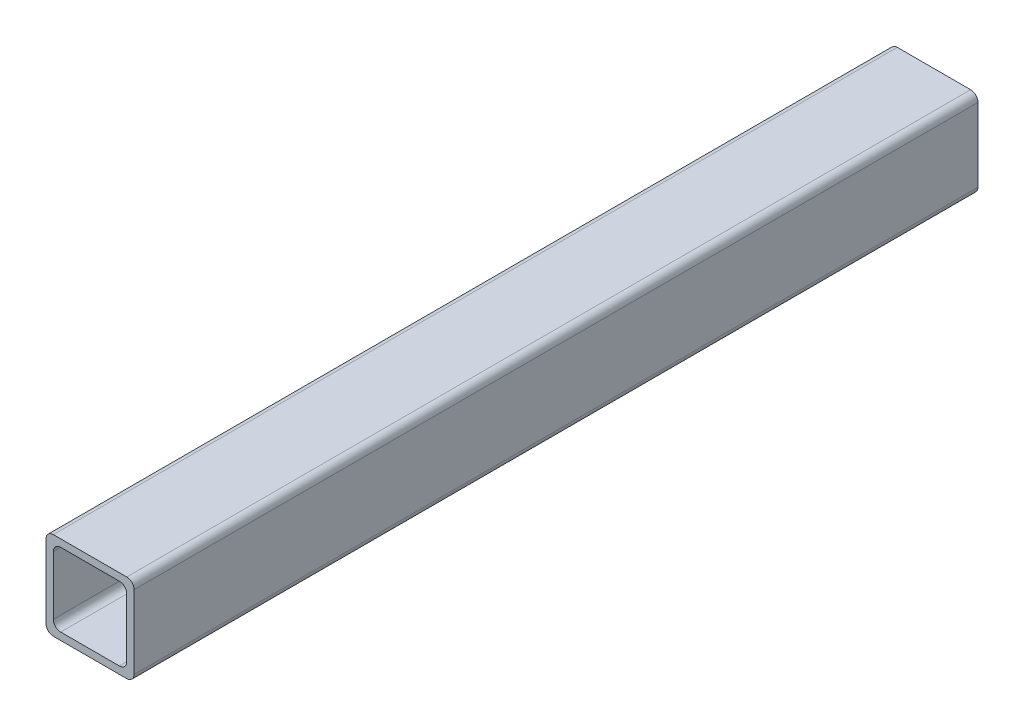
ISO-10303-21;
HEADER;
FILE_DESCRIPTION(('STEP AP214'),'2;1');
FILE_NAME('part.step','',(''),(''),'','','');
FILE_SCHEMA(('AUTOMOTIVE_DESIGN { 1 0 10303 214 1 1 1 1 }'));
ENDSEC;
DATA;
#1=APPLICATION_CONTEXT('core data for automotive mechanical design processes');
#2=APPLICATION_PROTOCOL_DEFINITION('international standard','automotive_design',2000,#1);
#3=PRODUCT_CONTEXT('',#1,'mechanical');
#4=PRODUCT('Part','Part','',(#3));
#5=PRODUCT_RELATED_PRODUCT_CATEGORY('part','',(#4));
#6=PRODUCT_DEFINITION_FORMATION('','',#4);
#7=PRODUCT_DEFINITION_CONTEXT('part definition',#1,'design');
#8=PRODUCT_DEFINITION('design','',#6,#7);
#9=PRODUCT_DEFINITION_SHAPE('','',#8);
#10=(LENGTH_UNIT() NAMED_UNIT(*) SI_UNIT(.MILLI.,.METRE.));
#11=(NAMED_UNIT(*) PLANE_ANGLE_UNIT() SI_UNIT($,.RADIAN.));
#12=(NAMED_UNIT(*) SI_UNIT($,.STERADIAN.) SOLID_ANGLE_UNIT());
#13=UNCERTAINTY_MEASURE_WITH_UNIT(LENGTH_MEASURE(1.E-05),#10,'distance_accuracy_value','');
#14=(GEOMETRIC_REPRESENTATION_CONTEXT(3) GLOBAL_UNCERTAINTY_ASSIGNED_CONTEXT((#13)) GLOBAL_UNIT_ASSIGNED_CONTEXT((#10,
#11,#12)) REPRESENTATION_CONTEXT('',''));
#15=CARTESIAN_POINT('',(0.,0.,0.));
#16=DIRECTION('',(0.,0.,1.));
#17=DIRECTION('',(1.,0.,0.));
#18=AXIS2_PLACEMENT_3D('',#15,#16,#17);
#19=CARTESIAN_POINT('',(50.,-50.,575.));
#20=DIRECTION('',(0.,0.,1.));
#21=DIRECTION('',(1.,0.,0.));
#22=AXIS2_PLACEMENT_3D('',#19,#20,#21);
#23=PLANE('',#22);
#24=CARTESIAN_POINT('',(50.,-50.,575.));
#25=DIRECTION('',(0.,0.,1.));
#26=DIRECTION('',(1.,0.,0.));
#27=AXIS2_PLACEMENT_3D('',#24,#25,#26);
#28=CIRCLE('',#27,10.);
#29=CARTESIAN_POINT('',(49.9999999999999,-60.,575.));
#30=VERTEX_POINT('',#29);
#31=CARTESIAN_POINT('',(60.,-49.9999999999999,575.));
#32=VERTEX_POINT('',#31);
#33=EDGE_CURVE('E250',#30,#32,#28,.T.);
#34=ORIENTED_EDGE('',*,*,#33,.T.);
#35=DIRECTION('',(0.,1.,0.));
#36=VECTOR('',#35,1.);
#37=CARTESIAN_POINT('',(60.,-49.9999999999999,575.));
#38=LINE('',#37,#36);
#39=CARTESIAN_POINT('',(60.,50.,575.));
#40=VERTEX_POINT('',#39);
#41=EDGE_CURVE('E254',#32,#40,#38,.T.);
#42=ORIENTED_EDGE('',*,*,#41,.T.);
#43=CARTESIAN_POINT('',(50.,50.,575.));
#44=DIRECTION('',(0.,0.,1.));
#45=DIRECTION('',(-1.,0.,0.));
#46=AXIS2_PLACEMENT_3D('',#43,#44,#45);
#47=CIRCLE('',#46,10.);
#48=CARTESIAN_POINT('',(49.9999999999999,60.,575.));
#49=VERTEX_POINT('',#48);
#50=EDGE_CURVE('E258',#40,#49,#47,.T.);
#51=ORIENTED_EDGE('',*,*,#50,.T.);
#52=DIRECTION('',(-1.,0.,0.));
#53=VECTOR('',#52,1.);
#54=CARTESIAN_POINT('',(-49.9999999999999,60.,575.));
#55=LINE('',#54,#53);
#56=CARTESIAN_POINT('',(-49.9999999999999,60.,575.));
#57=VERTEX_POINT('',#56);
#58=EDGE_CURVE('E261',#49,#57,#55,.T.);
#59=ORIENTED_EDGE('',*,*,#58,.T.);
#60=CARTESIAN_POINT('',(-50.,50.,575.));
#61=DIRECTION('',(0.,0.,1.));
#62=DIRECTION('',(-1.,0.,0.));
#63=AXIS2_PLACEMENT_3D('',#60,#61,#62);
#64=CIRCLE('',#63,10.);
#65=CARTESIAN_POINT('',(-60.,50.,575.));
#66=VERTEX_POINT('',#65);
#67=EDGE_CURVE('E264',#57,#66,#64,.T.);
#68=ORIENTED_EDGE('',*,*,#67,.T.);
#69=DIRECTION('',(0.,-1.,0.));
#70=VECTOR('',#69,1.);
#71=CARTESIAN_POINT('',(-60.,-49.9999999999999,575.));
#72=LINE('',#71,#70);
#73=CARTESIAN_POINT('',(-60.,-50.,575.));
#74=VERTEX_POINT('',#73);
#75=EDGE_CURVE('E267',#66,#74,#72,.T.);
#76=ORIENTED_EDGE('',*,*,#75,.T.);
#77=CARTESIAN_POINT('',(-50.,-50.,575.));
#78=DIRECTION('',(0.,0.,1.));
#79=DIRECTION('',(-1.,0.,0.));
#80=AXIS2_PLACEMENT_3D('',#77,#78,#79);
#81=CIRCLE('',#80,10.);
#82=CARTESIAN_POINT('',(-49.9999999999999,-60.,575.));
#83=VERTEX_POINT('',#82);
#84=EDGE_CURVE('E270',#74,#83,#81,.T.);
#85=ORIENTED_EDGE('',*,*,#84,.T.);
#86=DIRECTION('',(1.,0.,0.));
#87=VECTOR('',#86,1.);
#88=CARTESIAN_POINT('',(-49.9999999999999,-60.,575.));
#89=LINE('',#88,#87);
#90=EDGE_CURVE('E273',#83,#30,#89,.T.);
#91=ORIENTED_EDGE('',*,*,#90,.T.);
#92=EDGE_LOOP('',(#34,#42,#51,#59,#68,#76,#85,#91));
#93=FACE_BOUND('',#92,.T.);
#94=DIRECTION('',(1.,0.,0.));
#95=VECTOR('',#94,1.);
#96=CARTESIAN_POINT('',(-39.9999999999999,-50.,575.));
#97=LINE('',#96,#95);
#98=CARTESIAN_POINT('',(-39.9999999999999,-50.,575.));
#99=VERTEX_POINT('',#98);
#100=CARTESIAN_POINT('',(39.9999999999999,-50.,575.));
#101=VERTEX_POINT('',#100);
#102=EDGE_CURVE('E168',#99,#101,#97,.T.);
#103=ORIENTED_EDGE('',*,*,#102,.F.);
#104=CARTESIAN_POINT('',(-40.,-40.,575.));
#105=DIRECTION('',(0.,0.,1.));
#106=DIRECTION('',(-1.,0.,0.));
#107=AXIS2_PLACEMENT_3D('',#104,#105,#106);
#108=CIRCLE('',#107,9.99999999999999);
#109=CARTESIAN_POINT('',(-50.,-39.9999999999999,575.));
#110=VERTEX_POINT('',#109);
#111=EDGE_CURVE('E159',#110,#99,#108,.T.);
#112=ORIENTED_EDGE('',*,*,#111,.F.);
#113=DIRECTION('',(0.,-1.,0.));
#114=VECTOR('',#113,1.);
#115=CARTESIAN_POINT('',(-50.,-39.9999999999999,575.));
#116=LINE('',#115,#114);
#117=CARTESIAN_POINT('',(-50.,39.9999999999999,575.));
#118=VERTEX_POINT('',#117);
#119=EDGE_CURVE('E201',#118,#110,#116,.T.);
#120=ORIENTED_EDGE('',*,*,#119,.F.);
#121=CARTESIAN_POINT('',(-40.,40.,575.));
#122=DIRECTION('',(0.,0.,1.));
#123=DIRECTION('',(-1.,0.,0.));
#124=AXIS2_PLACEMENT_3D('',#121,#122,#123);
#125=CIRCLE('',#124,9.99999999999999);
#126=CARTESIAN_POINT('',(-39.9999999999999,50.,575.));
#127=VERTEX_POINT('',#126);
#128=EDGE_CURVE('E198',#127,#118,#125,.T.);
#129=ORIENTED_EDGE('',*,*,#128,.F.);
#130=DIRECTION('',(-1.,0.,0.));
#131=VECTOR('',#130,1.);
#132=CARTESIAN_POINT('',(-39.9999999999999,50.,575.));
#133=LINE('',#132,#131);
#134=CARTESIAN_POINT('',(39.9999999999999,50.,575.));
#135=VERTEX_POINT('',#134);
#136=EDGE_CURVE('E195',#135,#127,#133,.T.);
#137=ORIENTED_EDGE('',*,*,#136,.F.);
#138=CARTESIAN_POINT('',(40.,40.,575.));
#139=DIRECTION('',(0.,0.,1.));
#140=DIRECTION('',(-1.,0.,0.));
#141=AXIS2_PLACEMENT_3D('',#138,#139,#140);
#142=CIRCLE('',#141,9.99999999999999);
#143=CARTESIAN_POINT('',(50.,39.9999999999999,575.));
#144=VERTEX_POINT('',#143);
#145=EDGE_CURVE('E192',#144,#135,#142,.T.);
#146=ORIENTED_EDGE('',*,*,#145,.F.);
#147=DIRECTION('',(0.,1.,0.));
#148=VECTOR('',#147,1.);
#149=CARTESIAN_POINT('',(50.,-39.9999999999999,575.));
#150=LINE('',#149,#148);
#151=CARTESIAN_POINT('',(50.,-40.,575.));
#152=VERTEX_POINT('',#151);
#153=EDGE_CURVE('E186',#152,#144,#150,.T.);
#154=ORIENTED_EDGE('',*,*,#153,.F.);
#155=CARTESIAN_POINT('',(40.,-40.,575.));
#156=DIRECTION('',(0.,0.,1.));
#157=DIRECTION('',(1.,0.,0.));
#158=AXIS2_PLACEMENT_3D('',#155,#156,#157);
#159=CIRCLE('',#158,9.99999999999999);
#160=EDGE_CURVE('E182',#101,#152,#159,.T.);
#161=ORIENTED_EDGE('',*,*,#160,.F.);
#162=EDGE_LOOP('',(#103,#112,#120,#129,#137,#146,#154,#161));
#163=FACE_BOUND('',#162,.T.);
#164=ADVANCED_FACE('F45',(#93,#163),#23,.T.);
#165=CARTESIAN_POINT('',(50.,-50.,-575.));
#166=DIRECTION('',(0.,0.,1.));
#167=DIRECTION('',(1.,0.,0.));
#168=AXIS2_PLACEMENT_3D('',#165,#166,#167);
#169=PLANE('',#168);
#170=CARTESIAN_POINT('',(50.,-50.,-575.));
#171=DIRECTION('',(0.,0.,1.));
#172=DIRECTION('',(1.,0.,0.));
#173=AXIS2_PLACEMENT_3D('',#170,#171,#172);
#174=CIRCLE('',#173,10.);
#175=CARTESIAN_POINT('',(49.9999999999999,-60.,-575.));
#176=VERTEX_POINT('',#175);
#177=CARTESIAN_POINT('',(60.,-49.9999999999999,-575.));
#178=VERTEX_POINT('',#177);
#179=EDGE_CURVE('E177',#176,#178,#174,.T.);
#180=ORIENTED_EDGE('',*,*,#179,.F.);
#181=DIRECTION('',(1.,0.,0.));
#182=VECTOR('',#181,1.);
#183=CARTESIAN_POINT('',(-49.9999999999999,-60.,-575.));
#184=LINE('',#183,#182);
#185=CARTESIAN_POINT('',(-49.9999999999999,-60.,-575.));
#186=VERTEX_POINT('',#185);
#187=EDGE_CURVE('E255',#186,#176,#184,.T.);
#188=ORIENTED_EDGE('',*,*,#187,.F.);
#189=CARTESIAN_POINT('',(-50.,-50.,-575.));
#190=DIRECTION('',(0.,0.,1.));
#191=DIRECTION('',(-1.,0.,0.));
#192=AXIS2_PLACEMENT_3D('',#189,#190,#191);
#193=CIRCLE('',#192,10.);
#194=CARTESIAN_POINT('',(-60.,-50.,-575.));
#195=VERTEX_POINT('',#194);
#196=EDGE_CURVE('E295',#195,#186,#193,.T.);
#197=ORIENTED_EDGE('',*,*,#196,.F.);
#198=DIRECTION('',(0.,-1.,0.));
#199=VECTOR('',#198,1.);
#200=CARTESIAN_POINT('',(-60.,-49.9999999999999,-575.));
#201=LINE('',#200,#199);
#202=CARTESIAN_POINT('',(-60.,50.,-575.));
#203=VERTEX_POINT('',#202);
#204=EDGE_CURVE('E292',#203,#195,#201,.T.);
#205=ORIENTED_EDGE('',*,*,#204,.F.);
#206=CARTESIAN_POINT('',(-50.,50.,-575.));
#207=DIRECTION('',(0.,0.,1.));
#208=DIRECTION('',(-1.,0.,0.));
#209=AXIS2_PLACEMENT_3D('',#206,#207,#208);
#210=CIRCLE('',#209,10.);
#211=CARTESIAN_POINT('',(-49.9999999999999,60.,-575.));
#212=VERTEX_POINT('',#211);
#213=EDGE_CURVE('E289',#212,#203,#210,.T.);
#214=ORIENTED_EDGE('',*,*,#213,.F.);
#215=DIRECTION('',(-1.,0.,0.));
#216=VECTOR('',#215,1.);
#217=CARTESIAN_POINT('',(-49.9999999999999,60.,-575.));
#218=LINE('',#217,#216);
#219=CARTESIAN_POINT('',(49.9999999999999,60.,-575.));
#220=VERTEX_POINT('',#219);
#221=EDGE_CURVE('E286',#220,#212,#218,.T.);
#222=ORIENTED_EDGE('',*,*,#221,.F.);
#223=CARTESIAN_POINT('',(50.,50.,-575.));
#224=DIRECTION('',(0.,0.,1.));
#225=DIRECTION('',(-1.,0.,0.));
#226=AXIS2_PLACEMENT_3D('',#223,#224,#225);
#227=CIRCLE('',#226,10.);
#228=CARTESIAN_POINT('',(60.,50.,-575.));
#229=VERTEX_POINT('',#228);
#230=EDGE_CURVE('E283',#229,#220,#227,.T.);
#231=ORIENTED_EDGE('',*,*,#230,.F.);
#232=DIRECTION('',(0.,1.,0.));
#233=VECTOR('',#232,1.);
#234=CARTESIAN_POINT('',(60.,-49.9999999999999,-575.));
#235=LINE('',#234,#233);
#236=EDGE_CURVE('E280',#178,#229,#235,.T.);
#237=ORIENTED_EDGE('',*,*,#236,.F.);
#238=EDGE_LOOP('',(#180,#188,#197,#205,#214,#222,#231,#237));
#239=FACE_BOUND('',#238,.T.);
#240=CARTESIAN_POINT('',(-40.,-40.,-575.));
#241=DIRECTION('',(0.,0.,1.));
#242=DIRECTION('',(-1.,0.,0.));
#243=AXIS2_PLACEMENT_3D('',#240,#241,#242);
#244=CIRCLE('',#243,9.99999999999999);
#245=CARTESIAN_POINT('',(-50.,-39.9999999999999,-575.));
#246=VERTEX_POINT('',#245);
#247=CARTESIAN_POINT('',(-39.9999999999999,-50.,-575.));
#248=VERTEX_POINT('',#247);
#249=EDGE_CURVE('E69',#246,#248,#244,.T.);
#250=ORIENTED_EDGE('',*,*,#249,.T.);
#251=DIRECTION('',(1.,0.,0.));
#252=VECTOR('',#251,1.);
#253=CARTESIAN_POINT('',(-39.9999999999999,-50.,-575.));
#254=LINE('',#253,#252);
#255=CARTESIAN_POINT('',(39.9999999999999,-50.,-575.));
#256=VERTEX_POINT('',#255);
#257=EDGE_CURVE('E175',#248,#256,#254,.T.);
#258=ORIENTED_EDGE('',*,*,#257,.T.);
#259=CARTESIAN_POINT('',(40.,-40.,-575.));
#260=DIRECTION('',(0.,0.,1.));
#261=DIRECTION('',(1.,0.,0.));
#262=AXIS2_PLACEMENT_3D('',#259,#260,#261);
#263=CIRCLE('',#262,9.99999999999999);
#264=CARTESIAN_POINT('',(50.,-40.,-575.));
#265=VERTEX_POINT('',#264);
#266=EDGE_CURVE('E209',#256,#265,#263,.T.);
#267=ORIENTED_EDGE('',*,*,#266,.T.);
#268=DIRECTION('',(0.,1.,0.));
#269=VECTOR('',#268,1.);
#270=CARTESIAN_POINT('',(50.,-39.9999999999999,-575.));
#271=LINE('',#270,#269);
#272=CARTESIAN_POINT('',(50.,39.9999999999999,-575.));
#273=VERTEX_POINT('',#272);
#274=EDGE_CURVE('E213',#265,#273,#271,.T.);
#275=ORIENTED_EDGE('',*,*,#274,.T.);
#276=CARTESIAN_POINT('',(40.,40.,-575.));
#277=DIRECTION('',(0.,0.,1.));
#278=DIRECTION('',(-1.,0.,0.));
#279=AXIS2_PLACEMENT_3D('',#276,#277,#278);
#280=CIRCLE('',#279,9.99999999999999);
#281=CARTESIAN_POINT('',(39.9999999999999,50.,-575.));
#282=VERTEX_POINT('',#281);
#283=EDGE_CURVE('E217',#273,#282,#280,.T.);
#284=ORIENTED_EDGE('',*,*,#283,.T.);
#285=DIRECTION('',(-1.,0.,0.));
#286=VECTOR('',#285,1.);
#287=CARTESIAN_POINT('',(-39.9999999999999,50.,-575.));
#288=LINE('',#287,#286);
#289=CARTESIAN_POINT('',(-39.9999999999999,50.,-575.));
#290=VERTEX_POINT('',#289);
#291=EDGE_CURVE('E221',#282,#290,#288,.T.);
#292=ORIENTED_EDGE('',*,*,#291,.T.);
#293=CARTESIAN_POINT('',(-40.,40.,-575.));
#294=DIRECTION('',(0.,0.,1.));
#295=DIRECTION('',(-1.,0.,0.));
#296=AXIS2_PLACEMENT_3D('',#293,#294,#295);
#297=CIRCLE('',#296,9.99999999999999);
#298=CARTESIAN_POINT('',(-50.,39.9999999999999,-575.));
#299=VERTEX_POINT('',#298);
#300=EDGE_CURVE('E225',#290,#299,#297,.T.);
#301=ORIENTED_EDGE('',*,*,#300,.T.);
#302=DIRECTION('',(0.,-1.,0.));
#303=VECTOR('',#302,1.);
#304=CARTESIAN_POINT('',(-50.,-39.9999999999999,-575.));
#305=LINE('',#304,#303);
#306=EDGE_CURVE('E169',#299,#246,#305,.T.);
#307=ORIENTED_EDGE('',*,*,#306,.T.);
#308=EDGE_LOOP('',(#250,#258,#267,#275,#284,#292,#301,#307));
#309=FACE_BOUND('',#308,.T.);
#310=ADVANCED_FACE('F334',(#239,#309),#169,.F.);
#311=CARTESIAN_POINT('',(50.,-50.,575.));
#312=DIRECTION('',(0.,0.,-1.));
#313=DIRECTION('',(-1.,0.,0.));
#314=AXIS2_PLACEMENT_3D('',#311,#312,#313);
#315=CYLINDRICAL_SURFACE('',#314,10.);
#316=ORIENTED_EDGE('',*,*,#179,.T.);
#317=DIRECTION('',(0.,0.,-1.));
#318=VECTOR('',#317,1.);
#319=CARTESIAN_POINT('',(60.,-49.9999999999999,575.));
#320=LINE('',#319,#318);
#321=EDGE_CURVE('E11',#32,#178,#320,.T.);
#322=ORIENTED_EDGE('',*,*,#321,.F.);
#323=ORIENTED_EDGE('',*,*,#33,.F.);
#324=DIRECTION('',(0.,0.,-1.));
#325=VECTOR('',#324,1.);
#326=CARTESIAN_POINT('',(49.9999999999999,-60.,575.));
#327=LINE('',#326,#325);
#328=EDGE_CURVE('E276',#30,#176,#327,.T.);
#329=ORIENTED_EDGE('',*,*,#328,.T.);
#330=EDGE_LOOP('',(#316,#322,#323,#329));
#331=FACE_BOUND('',#330,.T.);
#332=ADVANCED_FACE('F47',(#331),#315,.T.);
#333=CARTESIAN_POINT('',(60.,-49.9999999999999,575.));
#334=DIRECTION('',(-1.,0.,0.));
#335=DIRECTION('',(0.,0.,1.));
#336=AXIS2_PLACEMENT_3D('',#333,#334,#335);
#337=PLANE('',#336);
#338=ORIENTED_EDGE('',*,*,#236,.T.);
#339=DIRECTION('',(0.,0.,-1.));
#340=VECTOR('',#339,1.);
#341=CARTESIAN_POINT('',(60.,50.,575.));
#342=LINE('',#341,#340);
#343=EDGE_CURVE('E54',#40,#229,#342,.T.);
#344=ORIENTED_EDGE('',*,*,#343,.F.);
#345=ORIENTED_EDGE('',*,*,#41,.F.);
#346=ORIENTED_EDGE('',*,*,#321,.T.);
#347=EDGE_LOOP('',(#338,#344,#345,#346));
#348=FACE_BOUND('',#347,.T.);
#349=ADVANCED_FACE('F351',(#348),#337,.F.);
#350=CARTESIAN_POINT('',(50.,50.,575.));
#351=DIRECTION('',(0.,0.,-1.));
#352=DIRECTION('',(-1.,0.,0.));
#353=AXIS2_PLACEMENT_3D('',#350,#351,#352);
#354=CYLINDRICAL_SURFACE('',#353,10.);
#355=ORIENTED_EDGE('',*,*,#230,.T.);
#356=DIRECTION('',(0.,0.,-1.));
#357=VECTOR('',#356,1.);
#358=CARTESIAN_POINT('',(49.9999999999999,60.,575.));
#359=LINE('',#358,#357);
#360=EDGE_CURVE('E319',#49,#220,#359,.T.);
#361=ORIENTED_EDGE('',*,*,#360,.F.);
#362=ORIENTED_EDGE('',*,*,#50,.F.);
#363=ORIENTED_EDGE('',*,*,#343,.T.);
#364=EDGE_LOOP('',(#355,#361,#362,#363));
#365=FACE_BOUND('',#364,.T.);
#366=ADVANCED_FACE('F328',(#365),#354,.T.);
#367=CARTESIAN_POINT('',(-49.9999999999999,60.,575.));
#368=DIRECTION('',(0.,-1.,0.));
#369=DIRECTION('',(0.,0.,-1.));
#370=AXIS2_PLACEMENT_3D('',#367,#368,#369);
#371=PLANE('',#370);
#372=ORIENTED_EDGE('',*,*,#221,.T.);
#373=DIRECTION('',(0.,0.,-1.));
#374=VECTOR('',#373,1.);
#375=CARTESIAN_POINT('',(-49.9999999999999,60.,575.));
#376=LINE('',#375,#374);
#377=EDGE_CURVE('E315',#57,#212,#376,.T.);
#378=ORIENTED_EDGE('',*,*,#377,.F.);
#379=ORIENTED_EDGE('',*,*,#58,.F.);
#380=ORIENTED_EDGE('',*,*,#360,.T.);
#381=EDGE_LOOP('',(#372,#378,#379,#380));
#382=FACE_BOUND('',#381,.T.);
#383=ADVANCED_FACE('F340',(#382),#371,.F.);
#384=CARTESIAN_POINT('',(-50.,50.,575.));
#385=DIRECTION('',(0.,0.,-1.));
#386=DIRECTION('',(-1.,0.,0.));
#387=AXIS2_PLACEMENT_3D('',#384,#385,#386);
#388=CYLINDRICAL_SURFACE('',#387,10.);
#389=ORIENTED_EDGE('',*,*,#213,.T.);
#390=DIRECTION('',(0.,0.,-1.));
#391=VECTOR('',#390,1.);
#392=CARTESIAN_POINT('',(-60.,50.,575.));
#393=LINE('',#392,#391);
#394=EDGE_CURVE('E311',#66,#203,#393,.T.);
#395=ORIENTED_EDGE('',*,*,#394,.F.);
#396=ORIENTED_EDGE('',*,*,#67,.F.);
#397=ORIENTED_EDGE('',*,*,#377,.T.);
#398=EDGE_LOOP('',(#389,#395,#396,#397));
#399=FACE_BOUND('',#398,.T.);
#400=ADVANCED_FACE('F344',(#399),#388,.T.);
#401=CARTESIAN_POINT('',(-60.,-49.9999999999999,575.));
#402=DIRECTION('',(1.,0.,0.));
#403=DIRECTION('',(0.,0.,-1.));
#404=AXIS2_PLACEMENT_3D('',#401,#402,#403);
#405=PLANE('',#404);
#406=ORIENTED_EDGE('',*,*,#204,.T.);
#407=DIRECTION('',(0.,0.,-1.));
#408=VECTOR('',#407,1.);
#409=CARTESIAN_POINT('',(-60.,-50.,575.));
#410=LINE('',#409,#408);
#411=EDGE_CURVE('E307',#74,#195,#410,.T.);
#412=ORIENTED_EDGE('',*,*,#411,.F.);
#413=ORIENTED_EDGE('',*,*,#75,.F.);
#414=ORIENTED_EDGE('',*,*,#394,.T.);
#415=EDGE_LOOP('',(#406,#412,#413,#414));
#416=FACE_BOUND('',#415,.T.);
#417=ADVANCED_FACE('F364',(#416),#405,.F.);
#418=CARTESIAN_POINT('',(-50.,-50.,575.));
#419=DIRECTION('',(0.,0.,-1.));
#420=DIRECTION('',(-1.,0.,0.));
#421=AXIS2_PLACEMENT_3D('',#418,#419,#420);
#422=CYLINDRICAL_SURFACE('',#421,10.);
#423=ORIENTED_EDGE('',*,*,#196,.T.);
#424=DIRECTION('',(0.,0.,-1.));
#425=VECTOR('',#424,1.);
#426=CARTESIAN_POINT('',(-49.9999999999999,-60.,575.));
#427=LINE('',#426,#425);
#428=EDGE_CURVE('E303',#83,#186,#427,.T.);
#429=ORIENTED_EDGE('',*,*,#428,.F.);
#430=ORIENTED_EDGE('',*,*,#84,.F.);
#431=ORIENTED_EDGE('',*,*,#411,.T.);
#432=EDGE_LOOP('',(#423,#429,#430,#431));
#433=FACE_BOUND('',#432,.T.);
#434=ADVANCED_FACE('F362',(#433),#422,.T.);
#435=CARTESIAN_POINT('',(-49.9999999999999,-60.,575.));
#436=DIRECTION('',(0.,1.,0.));
#437=DIRECTION('',(0.,0.,1.));
#438=AXIS2_PLACEMENT_3D('',#435,#436,#437);
#439=PLANE('',#438);
#440=CARTESIAN_POINT('',(0.,-60.,498.5));
#441=DIRECTION('',(0.,-1.,0.));
#442=DIRECTION('',(0.,0.,-1.));
#443=AXIS2_PLACEMENT_3D('',#440,#441,#442);
#444=CIRCLE('',#443,8.49999999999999);
#445=CARTESIAN_POINT('',(0.,-60.,490.));
#446=VERTEX_POINT('',#445);
#447=EDGE_CURVE('E392',#446,#446,#444,.T.);
#448=ORIENTED_EDGE('',*,*,#447,.F.);
#449=EDGE_LOOP('',(#448));
#450=FACE_BOUND('',#449,.T.);
#451=CARTESIAN_POINT('',(0.,-60.,-498.5));
#452=DIRECTION('',(0.,-1.,0.));
#453=DIRECTION('',(0.,0.,1.));
#454=AXIS2_PLACEMENT_3D('',#451,#452,#453);
#455=CIRCLE('',#454,8.49999999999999);
#456=CARTESIAN_POINT('',(0.,-60.,-490.));
#457=VERTEX_POINT('',#456);
#458=EDGE_CURVE('E395',#457,#457,#455,.T.);
#459=ORIENTED_EDGE('',*,*,#458,.F.);
#460=EDGE_LOOP('',(#459));
#461=FACE_BOUND('',#460,.T.);
#462=ORIENTED_EDGE('',*,*,#187,.T.);
#463=ORIENTED_EDGE('',*,*,#328,.F.);
#464=ORIENTED_EDGE('',*,*,#90,.F.);
#465=ORIENTED_EDGE('',*,*,#428,.T.);
#466=EDGE_LOOP('',(#462,#463,#464,#465));
#467=FACE_BOUND('',#466,.T.);
#468=ADVANCED_FACE('F357',(#450,#461,#467),#439,.F.);
#469=CARTESIAN_POINT('',(-40.,-40.,575.));
#470=DIRECTION('',(0.,0.,-1.));
#471=DIRECTION('',(-1.,0.,0.));
#472=AXIS2_PLACEMENT_3D('',#469,#470,#471);
#473=CYLINDRICAL_SURFACE('',#472,9.99999999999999);
#474=ORIENTED_EDGE('',*,*,#249,.F.);
#475=DIRECTION('',(0.,0.,-1.));
#476=VECTOR('',#475,1.);
#477=CARTESIAN_POINT('',(-50.,-39.9999999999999,575.));
#478=LINE('',#477,#476);
#479=EDGE_CURVE('E163',#110,#246,#478,.T.);
#480=ORIENTED_EDGE('',*,*,#479,.F.);
#481=ORIENTED_EDGE('',*,*,#111,.T.);
#482=DIRECTION('',(0.,0.,-1.));
#483=VECTOR('',#482,1.);
#484=CARTESIAN_POINT('',(-39.9999999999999,-50.,575.));
#485=LINE('',#484,#483);
#486=EDGE_CURVE('E162',#99,#248,#485,.T.);
#487=ORIENTED_EDGE('',*,*,#486,.T.);
#488=EDGE_LOOP('',(#474,#480,#481,#487));
#489=FACE_BOUND('',#488,.T.);
#490=ADVANCED_FACE('F161',(#489),#473,.F.);
#491=CARTESIAN_POINT('',(-39.9999999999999,-50.,575.));
#492=DIRECTION('',(0.,1.,0.));
#493=DIRECTION('',(0.,0.,1.));
#494=AXIS2_PLACEMENT_3D('',#491,#492,#493);
#495=PLANE('',#494);
#496=CARTESIAN_POINT('',(0.,-50.,498.5));
#497=DIRECTION('',(0.,-1.,0.));
#498=DIRECTION('',(0.,0.,-1.));
#499=AXIS2_PLACEMENT_3D('',#496,#497,#498);
#500=CIRCLE('',#499,8.49999999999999);
#501=CARTESIAN_POINT('',(0.,-50.,490.));
#502=VERTEX_POINT('',#501);
#503=EDGE_CURVE('E206',#502,#502,#500,.T.);
#504=ORIENTED_EDGE('',*,*,#503,.T.);
#505=EDGE_LOOP('',(#504));
#506=FACE_BOUND('',#505,.T.);
#507=CARTESIAN_POINT('',(0.,-50.,-498.5));
#508=DIRECTION('',(0.,-1.,0.));
#509=DIRECTION('',(0.,0.,1.));
#510=AXIS2_PLACEMENT_3D('',#507,#508,#509);
#511=CIRCLE('',#510,8.49999999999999);
#512=CARTESIAN_POINT('',(0.,-50.,-490.));
#513=VERTEX_POINT('',#512);
#514=EDGE_CURVE('E398',#513,#513,#511,.T.);
#515=ORIENTED_EDGE('',*,*,#514,.T.);
#516=EDGE_LOOP('',(#515));
#517=FACE_BOUND('',#516,.T.);
#518=ORIENTED_EDGE('',*,*,#257,.F.);
#519=ORIENTED_EDGE('',*,*,#486,.F.);
#520=ORIENTED_EDGE('',*,*,#102,.T.);
#521=DIRECTION('',(0.,0.,-1.));
#522=VECTOR('',#521,1.);
#523=CARTESIAN_POINT('',(39.9999999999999,-50.,575.));
#524=LINE('',#523,#522);
#525=EDGE_CURVE('E178',#101,#256,#524,.T.);
#526=ORIENTED_EDGE('',*,*,#525,.T.);
#527=EDGE_LOOP('',(#518,#519,#520,#526));
#528=FACE_BOUND('',#527,.T.);
#529=ADVANCED_FACE('F172',(#506,#517,#528),#495,.T.);
#530=CARTESIAN_POINT('',(40.,-40.,575.));
#531=DIRECTION('',(0.,0.,-1.));
#532=DIRECTION('',(-1.,0.,0.));
#533=AXIS2_PLACEMENT_3D('',#530,#531,#532);
#534=CYLINDRICAL_SURFACE('',#533,9.99999999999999);
#535=ORIENTED_EDGE('',*,*,#266,.F.);
#536=ORIENTED_EDGE('',*,*,#525,.F.);
#537=ORIENTED_EDGE('',*,*,#160,.T.);
#538=DIRECTION('',(0.,0.,-1.));
#539=VECTOR('',#538,1.);
#540=CARTESIAN_POINT('',(50.,-40.,575.));
#541=LINE('',#540,#539);
#542=EDGE_CURVE('E245',#152,#265,#541,.T.);
#543=ORIENTED_EDGE('',*,*,#542,.T.);
#544=EDGE_LOOP('',(#535,#536,#537,#543));
#545=FACE_BOUND('',#544,.T.);
#546=ADVANCED_FACE('F439',(#545),#534,.F.);
#547=CARTESIAN_POINT('',(50.,-39.9999999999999,575.));
#548=DIRECTION('',(-1.,0.,0.));
#549=DIRECTION('',(0.,0.,1.));
#550=AXIS2_PLACEMENT_3D('',#547,#548,#549);
#551=PLANE('',#550);
#552=ORIENTED_EDGE('',*,*,#274,.F.);
#553=ORIENTED_EDGE('',*,*,#542,.F.);
#554=ORIENTED_EDGE('',*,*,#153,.T.);
#555=DIRECTION('',(0.,0.,-1.));
#556=VECTOR('',#555,1.);
#557=CARTESIAN_POINT('',(50.,39.9999999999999,575.));
#558=LINE('',#557,#556);
#559=EDGE_CURVE('E242',#144,#273,#558,.T.);
#560=ORIENTED_EDGE('',*,*,#559,.T.);
#561=EDGE_LOOP('',(#552,#553,#554,#560));
#562=FACE_BOUND('',#561,.T.);
#563=ADVANCED_FACE('F435',(#562),#551,.T.);
#564=CARTESIAN_POINT('',(40.,40.,575.));
#565=DIRECTION('',(0.,0.,-1.));
#566=DIRECTION('',(-1.,0.,0.));
#567=AXIS2_PLACEMENT_3D('',#564,#565,#566);
#568=CYLINDRICAL_SURFACE('',#567,9.99999999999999);
#569=ORIENTED_EDGE('',*,*,#283,.F.);
#570=ORIENTED_EDGE('',*,*,#559,.F.);
#571=ORIENTED_EDGE('',*,*,#145,.T.);
#572=DIRECTION('',(0.,0.,-1.));
#573=VECTOR('',#572,1.);
#574=CARTESIAN_POINT('',(39.9999999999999,50.,575.));
#575=LINE('',#574,#573);
#576=EDGE_CURVE('E239',#135,#282,#575,.T.);
#577=ORIENTED_EDGE('',*,*,#576,.T.);
#578=EDGE_LOOP('',(#569,#570,#571,#577));
#579=FACE_BOUND('',#578,.T.);
#580=ADVANCED_FACE('F431',(#579),#568,.F.);
#581=CARTESIAN_POINT('',(-39.9999999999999,50.,575.));
#582=DIRECTION('',(0.,-1.,0.));
#583=DIRECTION('',(0.,0.,-1.));
#584=AXIS2_PLACEMENT_3D('',#581,#582,#583);
#585=PLANE('',#584);
#586=ORIENTED_EDGE('',*,*,#291,.F.);
#587=ORIENTED_EDGE('',*,*,#576,.F.);
#588=ORIENTED_EDGE('',*,*,#136,.T.);
#589=DIRECTION('',(0.,0.,-1.));
#590=VECTOR('',#589,1.);
#591=CARTESIAN_POINT('',(-39.9999999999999,50.,575.));
#592=LINE('',#591,#590);
#593=EDGE_CURVE('E236',#127,#290,#592,.T.);
#594=ORIENTED_EDGE('',*,*,#593,.T.);
#595=EDGE_LOOP('',(#586,#587,#588,#594));
#596=FACE_BOUND('',#595,.T.);
#597=ADVANCED_FACE('F427',(#596),#585,.T.);
#598=CARTESIAN_POINT('',(-40.,40.,575.));
#599=DIRECTION('',(0.,0.,-1.));
#600=DIRECTION('',(-1.,0.,0.));
#601=AXIS2_PLACEMENT_3D('',#598,#599,#600);
#602=CYLINDRICAL_SURFACE('',#601,9.99999999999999);
#603=ORIENTED_EDGE('',*,*,#300,.F.);
#604=ORIENTED_EDGE('',*,*,#593,.F.);
#605=ORIENTED_EDGE('',*,*,#128,.T.);
#606=DIRECTION('',(0.,0.,-1.));
#607=VECTOR('',#606,1.);
#608=CARTESIAN_POINT('',(-50.,39.9999999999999,575.));
#609=LINE('',#608,#607);
#610=EDGE_CURVE('E61',#118,#299,#609,.T.);
#611=ORIENTED_EDGE('',*,*,#610,.T.);
#612=EDGE_LOOP('',(#603,#604,#605,#611));
#613=FACE_BOUND('',#612,.T.);
#614=ADVANCED_FACE('F424',(#613),#602,.F.);
#615=CARTESIAN_POINT('',(-50.,-39.9999999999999,575.));
#616=DIRECTION('',(1.,0.,0.));
#617=DIRECTION('',(0.,0.,-1.));
#618=AXIS2_PLACEMENT_3D('',#615,#616,#617);
#619=PLANE('',#618);
#620=ORIENTED_EDGE('',*,*,#306,.F.);
#621=ORIENTED_EDGE('',*,*,#610,.F.);
#622=ORIENTED_EDGE('',*,*,#119,.T.);
#623=ORIENTED_EDGE('',*,*,#479,.T.);
#624=EDGE_LOOP('',(#620,#621,#622,#623));
#625=FACE_BOUND('',#624,.T.);
#626=ADVANCED_FACE('F419',(#625),#619,.T.);
#627=CARTESIAN_POINT('',(0.,-50.,-498.5));
#628=DIRECTION('',(0.,-1.,0.));
#629=DIRECTION('',(0.,0.,-1.));
#630=AXIS2_PLACEMENT_3D('',#627,#628,#629);
#631=CYLINDRICAL_SURFACE('',#630,8.49999999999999);
#632=ORIENTED_EDGE('',*,*,#514,.F.);
#633=EDGE_LOOP('',(#632));
#634=FACE_BOUND('',#633,.T.);
#635=ORIENTED_EDGE('',*,*,#458,.T.);
#636=EDGE_LOOP('',(#635));
#637=FACE_BOUND('',#636,.T.);
#638=ADVANCED_FACE('F414',(#634,#637),#631,.F.);
#639=CARTESIAN_POINT('',(0.,-50.,498.5));
#640=DIRECTION('',(0.,-1.,0.));
#641=DIRECTION('',(0.,0.,-1.));
#642=AXIS2_PLACEMENT_3D('',#639,#640,#641);
#643=CYLINDRICAL_SURFACE('',#642,8.49999999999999);
#644=ORIENTED_EDGE('',*,*,#503,.F.);
#645=EDGE_LOOP('',(#644));
#646=FACE_BOUND('',#645,.T.);
#647=ORIENTED_EDGE('',*,*,#447,.T.);
#648=EDGE_LOOP('',(#647));
#649=FACE_BOUND('',#648,.T.);
#650=ADVANCED_FACE('F411',(#646,#649),#643,.F.);
#651=CLOSED_SHELL('',(#164,#310,#332,#349,#366,#383,#400,#417,#434,#468,#490,#529,#546,#563,
#580,#597,#614,#626,#638,#650));
#652=MANIFOLD_SOLID_BREP('B2',#651);
#653=ADVANCED_BREP_SHAPE_REPRESENTATION('',(#18,#652),#14);
#654=SHAPE_DEFINITION_REPRESENTATION(#9,#653);
ENDSEC;
END-ISO-10303-21;
